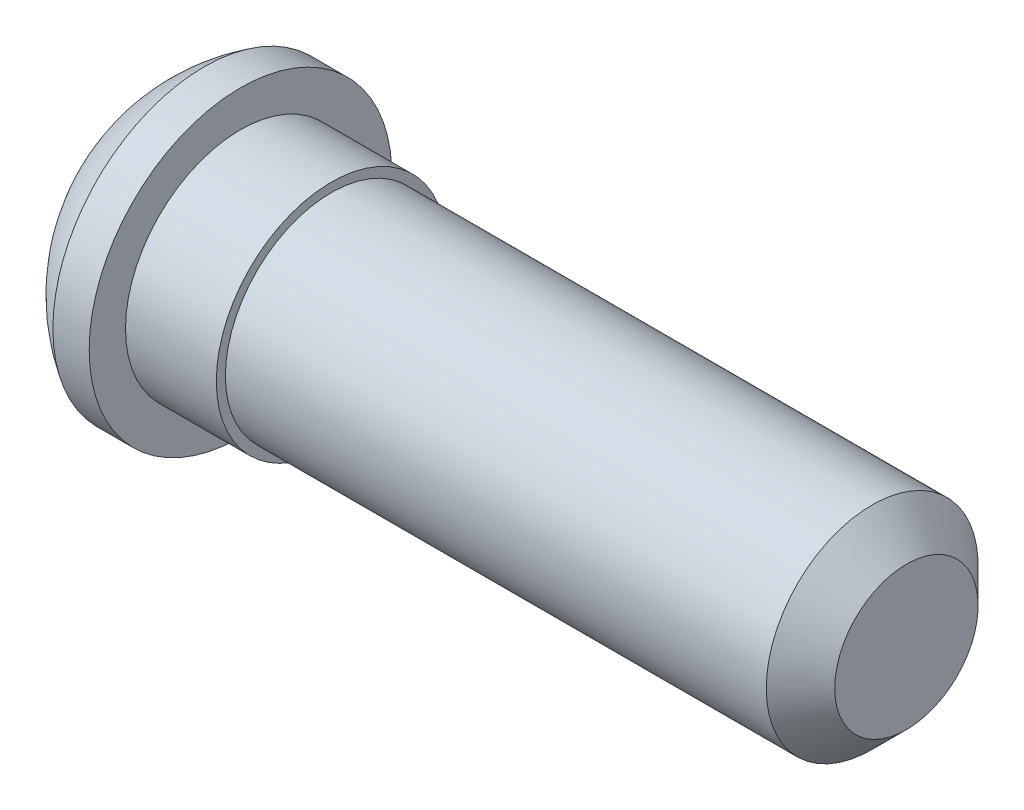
ISO-10303-21;
HEADER;
FILE_DESCRIPTION(('STEP AP214'),'2;1');
FILE_NAME('part.step','',(''),(''),'','','');
FILE_SCHEMA(('AUTOMOTIVE_DESIGN { 1 0 10303 214 1 1 1 1 }'));
ENDSEC;
DATA;
#1=APPLICATION_CONTEXT('core data for automotive mechanical design processes');
#2=APPLICATION_PROTOCOL_DEFINITION('international standard','automotive_design',2000,#1);
#3=PRODUCT_CONTEXT('',#1,'mechanical');
#4=PRODUCT('Part','Part','',(#3));
#5=PRODUCT_RELATED_PRODUCT_CATEGORY('part','',(#4));
#6=PRODUCT_DEFINITION_FORMATION('','',#4);
#7=PRODUCT_DEFINITION_CONTEXT('part definition',#1,'design');
#8=PRODUCT_DEFINITION('design','',#6,#7);
#9=PRODUCT_DEFINITION_SHAPE('','',#8);
#10=(LENGTH_UNIT() NAMED_UNIT(*) SI_UNIT(.MILLI.,.METRE.));
#11=(NAMED_UNIT(*) PLANE_ANGLE_UNIT() SI_UNIT($,.RADIAN.));
#12=(NAMED_UNIT(*) SI_UNIT($,.STERADIAN.) SOLID_ANGLE_UNIT());
#13=UNCERTAINTY_MEASURE_WITH_UNIT(LENGTH_MEASURE(1.E-05),#10,'distance_accuracy_value','');
#14=(GEOMETRIC_REPRESENTATION_CONTEXT(3) GLOBAL_UNCERTAINTY_ASSIGNED_CONTEXT((#13)) GLOBAL_UNIT_ASSIGNED_CONTEXT((#10,
#11,#12)) REPRESENTATION_CONTEXT('',''));
#15=CARTESIAN_POINT('',(0.,0.,0.));
#16=DIRECTION('',(0.,0.,1.));
#17=DIRECTION('',(1.,0.,0.));
#18=AXIS2_PLACEMENT_3D('',#15,#16,#17);
#19=CARTESIAN_POINT('',(9.30955357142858,0.,0.));
#20=DIRECTION('',(-1.,0.,0.));
#21=DIRECTION('',(0.,1.,0.));
#22=AXIS2_PLACEMENT_3D('',#19,#20,#21);
#23=SPHERICAL_SURFACE('',#22,9.30955357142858);
#24=CARTESIAN_POINT('',(4.445,0.,0.));
#25=DIRECTION('',(-1.,0.,0.));
#26=DIRECTION('',(0.,0.,1.));
#27=AXIS2_PLACEMENT_3D('',#24,#25,#26);
#28=CIRCLE('',#27,7.9375);
#29=CARTESIAN_POINT('',(4.445,0.,7.9375));
#30=VERTEX_POINT('',#29);
#31=EDGE_CURVE('E10',#30,#30,#28,.T.);
#32=ORIENTED_EDGE('',*,*,#31,.T.);
#33=EDGE_LOOP('',(#32));
#34=FACE_BOUND('',#33,.T.);
#35=ADVANCED_FACE('F34',(#34),#23,.T.);
#36=CARTESIAN_POINT('',(-46.862328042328,0.,0.));
#37=DIRECTION('',(-1.,0.,0.));
#38=DIRECTION('',(0.,0.,1.));
#39=AXIS2_PLACEMENT_3D('',#36,#37,#38);
#40=CYLINDRICAL_SURFACE('',#39,7.9375);
#41=ORIENTED_EDGE('',*,*,#31,.F.);
#42=EDGE_LOOP('',(#41));
#43=FACE_BOUND('',#42,.T.);
#44=CARTESIAN_POINT('',(6.35,0.,0.));
#45=DIRECTION('',(-1.,0.,0.));
#46=DIRECTION('',(0.,0.,1.));
#47=AXIS2_PLACEMENT_3D('',#44,#45,#46);
#48=CIRCLE('',#47,7.9375);
#49=CARTESIAN_POINT('',(6.35,0.,7.9375));
#50=VERTEX_POINT('',#49);
#51=EDGE_CURVE('E40',#50,#50,#48,.T.);
#52=ORIENTED_EDGE('',*,*,#51,.T.);
#53=EDGE_LOOP('',(#52));
#54=FACE_BOUND('',#53,.T.);
#55=ADVANCED_FACE('F75',(#43,#54),#40,.T.);
#56=CARTESIAN_POINT('',(6.35,7.9375,0.));
#57=DIRECTION('',(-1.,0.,0.));
#58=DIRECTION('',(0.,0.,1.));
#59=AXIS2_PLACEMENT_3D('',#56,#57,#58);
#60=PLANE('',#59);
#61=ORIENTED_EDGE('',*,*,#51,.F.);
#62=EDGE_LOOP('',(#61));
#63=FACE_BOUND('',#62,.T.);
#64=CARTESIAN_POINT('',(6.35,0.,0.));
#65=DIRECTION('',(-1.,0.,0.));
#66=DIRECTION('',(0.,0.,1.));
#67=AXIS2_PLACEMENT_3D('',#64,#65,#66);
#68=CIRCLE('',#67,6.0325);
#69=CARTESIAN_POINT('',(6.35,0.,6.0325));
#70=VERTEX_POINT('',#69);
#71=EDGE_CURVE('E44',#70,#70,#68,.T.);
#72=ORIENTED_EDGE('',*,*,#71,.T.);
#73=EDGE_LOOP('',(#72));
#74=FACE_BOUND('',#73,.T.);
#75=ADVANCED_FACE('F79',(#63,#74),#60,.F.);
#76=CARTESIAN_POINT('',(-46.862328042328,0.,0.));
#77=DIRECTION('',(-1.,0.,0.));
#78=DIRECTION('',(0.,0.,1.));
#79=AXIS2_PLACEMENT_3D('',#76,#77,#78);
#80=CYLINDRICAL_SURFACE('',#79,6.0325);
#81=ORIENTED_EDGE('',*,*,#71,.F.);
#82=EDGE_LOOP('',(#81));
#83=FACE_BOUND('',#82,.T.);
#84=CARTESIAN_POINT('',(11.1125,0.,0.));
#85=DIRECTION('',(-1.,0.,0.));
#86=DIRECTION('',(0.,0.,1.));
#87=AXIS2_PLACEMENT_3D('',#84,#85,#86);
#88=CIRCLE('',#87,6.0325);
#89=CARTESIAN_POINT('',(11.1125,0.,6.0325));
#90=VERTEX_POINT('',#89);
#91=EDGE_CURVE('E48',#90,#90,#88,.T.);
#92=ORIENTED_EDGE('',*,*,#91,.T.);
#93=EDGE_LOOP('',(#92));
#94=FACE_BOUND('',#93,.T.);
#95=ADVANCED_FACE('F84',(#83,#94),#80,.T.);
#96=CARTESIAN_POINT('',(11.1125,6.0325,0.));
#97=DIRECTION('',(-1.,0.,0.));
#98=DIRECTION('',(0.,0.,1.));
#99=AXIS2_PLACEMENT_3D('',#96,#97,#98);
#100=PLANE('',#99);
#101=ORIENTED_EDGE('',*,*,#91,.F.);
#102=EDGE_LOOP('',(#101));
#103=FACE_BOUND('',#102,.T.);
#104=CARTESIAN_POINT('',(11.1125,0.,0.));
#105=DIRECTION('',(-1.,0.,0.));
#106=DIRECTION('',(0.,0.,1.));
#107=AXIS2_PLACEMENT_3D('',#104,#105,#106);
#108=CIRCLE('',#107,5.55625);
#109=CARTESIAN_POINT('',(11.1125,0.,5.55625));
#110=VERTEX_POINT('',#109);
#111=EDGE_CURVE('E53',#110,#110,#108,.T.);
#112=ORIENTED_EDGE('',*,*,#111,.T.);
#113=EDGE_LOOP('',(#112));
#114=FACE_BOUND('',#113,.T.);
#115=ADVANCED_FACE('F90',(#103,#114),#100,.F.);
#116=CARTESIAN_POINT('',(-46.862328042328,0.,0.));
#117=DIRECTION('',(-1.,0.,0.));
#118=DIRECTION('',(0.,0.,1.));
#119=AXIS2_PLACEMENT_3D('',#116,#117,#118);
#120=CYLINDRICAL_SURFACE('',#119,5.55625);
#121=ORIENTED_EDGE('',*,*,#111,.F.);
#122=EDGE_LOOP('',(#121));
#123=FACE_BOUND('',#122,.T.);
#124=CARTESIAN_POINT('',(39.4789487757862,0.,0.));
#125=DIRECTION('',(-1.,0.,0.));
#126=DIRECTION('',(0.,0.,1.));
#127=AXIS2_PLACEMENT_3D('',#124,#125,#126);
#128=CIRCLE('',#127,5.55625);
#129=CARTESIAN_POINT('',(39.4789487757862,0.,5.55625));
#130=VERTEX_POINT('',#129);
#131=EDGE_CURVE('E56',#130,#130,#128,.T.);
#132=ORIENTED_EDGE('',*,*,#131,.T.);
#133=EDGE_LOOP('',(#132));
#134=FACE_BOUND('',#133,.T.);
#135=ADVANCED_FACE('F71',(#123,#134),#120,.T.);
#136=CARTESIAN_POINT('',(41.275,0.,0.));
#137=DIRECTION('',(-1.,0.,0.));
#138=DIRECTION('',(0.,0.,1.));
#139=AXIS2_PLACEMENT_3D('',#136,#137,#138);
#140=CONICAL_SURFACE('',#139,3.76019877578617,0.785398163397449);
#141=ORIENTED_EDGE('',*,*,#131,.F.);
#142=EDGE_LOOP('',(#141));
#143=FACE_BOUND('',#142,.T.);
#144=CARTESIAN_POINT('',(41.275,0.,0.));
#145=DIRECTION('',(-1.,0.,0.));
#146=DIRECTION('',(0.,0.,1.));
#147=AXIS2_PLACEMENT_3D('',#144,#145,#146);
#148=CIRCLE('',#147,3.76019877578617);
#149=CARTESIAN_POINT('',(41.275,0.,3.76019877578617));
#150=VERTEX_POINT('',#149);
#151=EDGE_CURVE('E59',#150,#150,#148,.T.);
#152=ORIENTED_EDGE('',*,*,#151,.T.);
#153=EDGE_LOOP('',(#152));
#154=FACE_BOUND('',#153,.T.);
#155=ADVANCED_FACE('F63',(#143,#154),#140,.T.);
#156=CARTESIAN_POINT('',(41.275,3.76019877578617,0.));
#157=DIRECTION('',(-1.,0.,0.));
#158=DIRECTION('',(0.,0.,1.));
#159=AXIS2_PLACEMENT_3D('',#156,#157,#158);
#160=PLANE('',#159);
#161=ORIENTED_EDGE('',*,*,#151,.F.);
#162=EDGE_LOOP('',(#161));
#163=FACE_BOUND('',#162,.T.);
#164=ADVANCED_FACE('F65',(#163),#160,.F.);
#165=CLOSED_SHELL('',(#35,#55,#75,#95,#115,#135,#155,#164));
#166=MANIFOLD_SOLID_BREP('B2',#165);
#167=ADVANCED_BREP_SHAPE_REPRESENTATION('',(#18,#166),#14);
#168=SHAPE_DEFINITION_REPRESENTATION(#9,#167);
ENDSEC;
END-ISO-10303-21;
